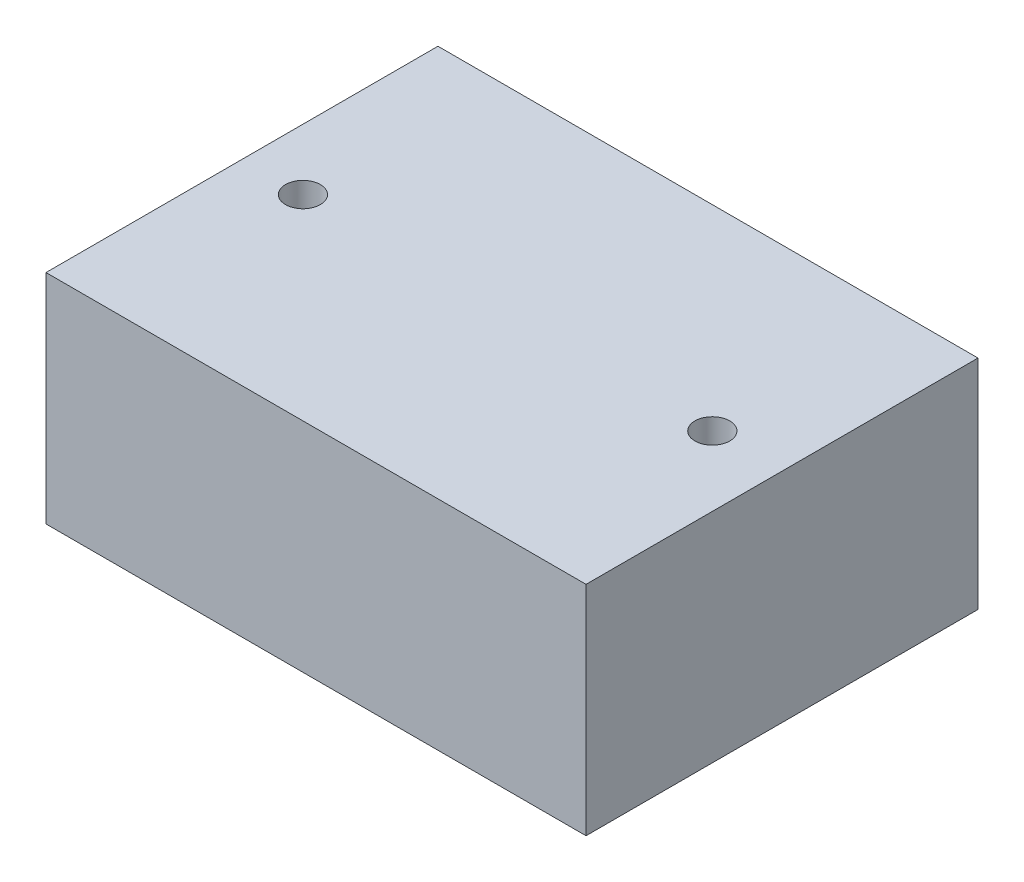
ISO-10303-21;
HEADER;
FILE_DESCRIPTION(('STEP AP214'),'2;1');
FILE_NAME('part.step','',(''),(''),'','','');
FILE_SCHEMA(('AUTOMOTIVE_DESIGN { 1 0 10303 214 1 1 1 1 }'));
ENDSEC;
DATA;
#1=APPLICATION_CONTEXT('core data for automotive mechanical design processes');
#2=APPLICATION_PROTOCOL_DEFINITION('international standard','automotive_design',2000,#1);
#3=PRODUCT_CONTEXT('',#1,'mechanical');
#4=PRODUCT('Part','Part','',(#3));
#5=PRODUCT_RELATED_PRODUCT_CATEGORY('part','',(#4));
#6=PRODUCT_DEFINITION_FORMATION('','',#4);
#7=PRODUCT_DEFINITION_CONTEXT('part definition',#1,'design');
#8=PRODUCT_DEFINITION('design','',#6,#7);
#9=PRODUCT_DEFINITION_SHAPE('','',#8);
#10=(LENGTH_UNIT() NAMED_UNIT(*) SI_UNIT(.MILLI.,.METRE.));
#11=(NAMED_UNIT(*) PLANE_ANGLE_UNIT() SI_UNIT($,.RADIAN.));
#12=(NAMED_UNIT(*) SI_UNIT($,.STERADIAN.) SOLID_ANGLE_UNIT());
#13=UNCERTAINTY_MEASURE_WITH_UNIT(LENGTH_MEASURE(1.E-05),#10,'distance_accuracy_value','');
#14=(GEOMETRIC_REPRESENTATION_CONTEXT(3) GLOBAL_UNCERTAINTY_ASSIGNED_CONTEXT((#13)) GLOBAL_UNIT_ASSIGNED_CONTEXT((#10,
#11,#12)) REPRESENTATION_CONTEXT('',''));
#15=CARTESIAN_POINT('',(0.,0.,0.));
#16=DIRECTION('',(0.,0.,1.));
#17=DIRECTION('',(1.,0.,0.));
#18=AXIS2_PLACEMENT_3D('',#15,#16,#17);
#19=CARTESIAN_POINT('',(-419.1,551.8,1054.8));
#20=DIRECTION('',(0.,1.,0.));
#21=DIRECTION('',(0.,0.,1.));
#22=AXIS2_PLACEMENT_3D('',#19,#20,#21);
#23=PLANE('',#22);
#24=CARTESIAN_POINT('',(-425.,551.8,1002.5));
#25=DIRECTION('',(0.,-1.,0.));
#26=DIRECTION('',(1.,0.,0.));
#27=AXIS2_PLACEMENT_3D('',#24,#25,#26);
#28=CIRCLE('',#27,2.0000000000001);
#29=CARTESIAN_POINT('',(-423.,551.8,1002.5));
#30=VERTEX_POINT('',#29);
#31=EDGE_CURVE('E11',#30,#30,#28,.T.);
#32=ORIENTED_EDGE('',*,*,#31,.T.);
#33=EDGE_LOOP('',(#32));
#34=FACE_BOUND('',#33,.T.);
#35=CARTESIAN_POINT('',(-378.,551.8,1002.5));
#36=DIRECTION('',(0.,-1.,0.));
#37=DIRECTION('',(1.,0.,0.));
#38=AXIS2_PLACEMENT_3D('',#35,#36,#37);
#39=CIRCLE('',#38,2.00000000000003);
#40=CARTESIAN_POINT('',(-376.,551.8,1002.5));
#41=VERTEX_POINT('',#40);
#42=EDGE_CURVE('E27',#41,#41,#39,.T.);
#43=ORIENTED_EDGE('',*,*,#42,.T.);
#44=EDGE_LOOP('',(#43));
#45=FACE_BOUND('',#44,.T.);
#46=DIRECTION('',(1.,0.,0.));
#47=VECTOR('',#46,1.);
#48=CARTESIAN_POINT('',(-432.,551.8,1025.));
#49=LINE('',#48,#47);
#50=CARTESIAN_POINT('',(-432.,551.8,1025.));
#51=VERTEX_POINT('',#50);
#52=CARTESIAN_POINT('',(-370.,551.8,1025.));
#53=VERTEX_POINT('',#52);
#54=EDGE_CURVE('E81',#51,#53,#49,.T.);
#55=ORIENTED_EDGE('',*,*,#54,.T.);
#56=DIRECTION('',(0.,0.,-1.));
#57=VECTOR('',#56,1.);
#58=CARTESIAN_POINT('',(-370.,551.8,1025.));
#59=LINE('',#58,#57);
#60=CARTESIAN_POINT('',(-370.,551.8,980.));
#61=VERTEX_POINT('',#60);
#62=EDGE_CURVE('E36',#53,#61,#59,.T.);
#63=ORIENTED_EDGE('',*,*,#62,.T.);
#64=DIRECTION('',(-1.,0.,0.));
#65=VECTOR('',#64,1.);
#66=CARTESIAN_POINT('',(-370.,551.8,980.));
#67=LINE('',#66,#65);
#68=CARTESIAN_POINT('',(-432.,551.8,980.));
#69=VERTEX_POINT('',#68);
#70=EDGE_CURVE('E68',#61,#69,#67,.T.);
#71=ORIENTED_EDGE('',*,*,#70,.T.);
#72=DIRECTION('',(0.,0.,1.));
#73=VECTOR('',#72,1.);
#74=CARTESIAN_POINT('',(-432.,551.8,980.));
#75=LINE('',#74,#73);
#76=EDGE_CURVE('E73',#69,#51,#75,.T.);
#77=ORIENTED_EDGE('',*,*,#76,.T.);
#78=EDGE_LOOP('',(#55,#63,#71,#77));
#79=FACE_BOUND('',#78,.T.);
#80=ADVANCED_FACE('F17',(#34,#45,#79),#23,.T.);
#81=CARTESIAN_POINT('',(-419.1,526.8,1054.8));
#82=DIRECTION('',(0.,-1.,0.));
#83=DIRECTION('',(0.,0.,-1.));
#84=AXIS2_PLACEMENT_3D('',#81,#82,#83);
#85=PLANE('',#84);
#86=CARTESIAN_POINT('',(-425.,526.8,1002.5));
#87=DIRECTION('',(0.,1.,0.));
#88=DIRECTION('',(1.,0.,0.));
#89=AXIS2_PLACEMENT_3D('',#86,#87,#88);
#90=CIRCLE('',#89,2.0000000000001);
#91=CARTESIAN_POINT('',(-423.,526.8,1002.5));
#92=VERTEX_POINT('',#91);
#93=EDGE_CURVE('E78',#92,#92,#90,.T.);
#94=ORIENTED_EDGE('',*,*,#93,.T.);
#95=EDGE_LOOP('',(#94));
#96=FACE_BOUND('',#95,.T.);
#97=CARTESIAN_POINT('',(-378.,526.8,1002.5));
#98=DIRECTION('',(0.,1.,0.));
#99=DIRECTION('',(1.,0.,0.));
#100=AXIS2_PLACEMENT_3D('',#97,#98,#99);
#101=CIRCLE('',#100,2.00000000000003);
#102=CARTESIAN_POINT('',(-376.,526.8,1002.5));
#103=VERTEX_POINT('',#102);
#104=EDGE_CURVE('E127',#103,#103,#101,.T.);
#105=ORIENTED_EDGE('',*,*,#104,.T.);
#106=EDGE_LOOP('',(#105));
#107=FACE_BOUND('',#106,.T.);
#108=DIRECTION('',(-1.,0.,0.));
#109=VECTOR('',#108,1.);
#110=CARTESIAN_POINT('',(-432.,526.8,1025.));
#111=LINE('',#110,#109);
#112=CARTESIAN_POINT('',(-370.,526.8,1025.));
#113=VERTEX_POINT('',#112);
#114=CARTESIAN_POINT('',(-432.,526.8,1025.));
#115=VERTEX_POINT('',#114);
#116=EDGE_CURVE('E129',#113,#115,#111,.T.);
#117=ORIENTED_EDGE('',*,*,#116,.T.);
#118=DIRECTION('',(0.,0.,-1.));
#119=VECTOR('',#118,1.);
#120=CARTESIAN_POINT('',(-432.,526.8,980.));
#121=LINE('',#120,#119);
#122=CARTESIAN_POINT('',(-432.,526.8,980.));
#123=VERTEX_POINT('',#122);
#124=EDGE_CURVE('E52',#115,#123,#121,.T.);
#125=ORIENTED_EDGE('',*,*,#124,.T.);
#126=DIRECTION('',(1.,0.,0.));
#127=VECTOR('',#126,1.);
#128=CARTESIAN_POINT('',(-370.,526.8,980.));
#129=LINE('',#128,#127);
#130=CARTESIAN_POINT('',(-370.,526.8,980.));
#131=VERTEX_POINT('',#130);
#132=EDGE_CURVE('E70',#123,#131,#129,.T.);
#133=ORIENTED_EDGE('',*,*,#132,.T.);
#134=DIRECTION('',(0.,0.,1.));
#135=VECTOR('',#134,1.);
#136=CARTESIAN_POINT('',(-370.,526.8,1025.));
#137=LINE('',#136,#135);
#138=EDGE_CURVE('E89',#131,#113,#137,.T.);
#139=ORIENTED_EDGE('',*,*,#138,.T.);
#140=EDGE_LOOP('',(#117,#125,#133,#139));
#141=FACE_BOUND('',#140,.T.);
#142=ADVANCED_FACE('F107',(#96,#107,#141),#85,.T.);
#143=CARTESIAN_POINT('',(-370.,551.8,1025.));
#144=DIRECTION('',(0.,0.,1.));
#145=DIRECTION('',(1.,0.,0.));
#146=AXIS2_PLACEMENT_3D('',#143,#144,#145);
#147=PLANE('',#146);
#148=ORIENTED_EDGE('',*,*,#54,.F.);
#149=DIRECTION('',(0.,-1.,0.));
#150=VECTOR('',#149,1.);
#151=CARTESIAN_POINT('',(-432.,551.8,1025.));
#152=LINE('',#151,#150);
#153=EDGE_CURVE('E71',#51,#115,#152,.T.);
#154=ORIENTED_EDGE('',*,*,#153,.T.);
#155=ORIENTED_EDGE('',*,*,#116,.F.);
#156=DIRECTION('',(0.,-1.,0.));
#157=VECTOR('',#156,1.);
#158=CARTESIAN_POINT('',(-370.,551.8,1025.));
#159=LINE('',#158,#157);
#160=EDGE_CURVE('E91',#53,#113,#159,.T.);
#161=ORIENTED_EDGE('',*,*,#160,.F.);
#162=EDGE_LOOP('',(#148,#154,#155,#161));
#163=FACE_BOUND('',#162,.T.);
#164=ADVANCED_FACE('F104',(#163),#147,.T.);
#165=CARTESIAN_POINT('',(-432.,551.8,1025.));
#166=DIRECTION('',(-1.,0.,0.));
#167=DIRECTION('',(0.,0.,1.));
#168=AXIS2_PLACEMENT_3D('',#165,#166,#167);
#169=PLANE('',#168);
#170=ORIENTED_EDGE('',*,*,#76,.F.);
#171=DIRECTION('',(0.,-1.,0.));
#172=VECTOR('',#171,1.);
#173=CARTESIAN_POINT('',(-432.,551.8,980.));
#174=LINE('',#173,#172);
#175=EDGE_CURVE('E57',#69,#123,#174,.T.);
#176=ORIENTED_EDGE('',*,*,#175,.T.);
#177=ORIENTED_EDGE('',*,*,#124,.F.);
#178=ORIENTED_EDGE('',*,*,#153,.F.);
#179=EDGE_LOOP('',(#170,#176,#177,#178));
#180=FACE_BOUND('',#179,.T.);
#181=ADVANCED_FACE('F74',(#180),#169,.T.);
#182=CARTESIAN_POINT('',(-432.,551.8,980.));
#183=DIRECTION('',(0.,0.,-1.));
#184=DIRECTION('',(-1.,0.,0.));
#185=AXIS2_PLACEMENT_3D('',#182,#183,#184);
#186=PLANE('',#185);
#187=ORIENTED_EDGE('',*,*,#70,.F.);
#188=DIRECTION('',(0.,-1.,0.));
#189=VECTOR('',#188,1.);
#190=CARTESIAN_POINT('',(-370.,551.8,980.));
#191=LINE('',#190,#189);
#192=EDGE_CURVE('E63',#61,#131,#191,.T.);
#193=ORIENTED_EDGE('',*,*,#192,.T.);
#194=ORIENTED_EDGE('',*,*,#132,.F.);
#195=ORIENTED_EDGE('',*,*,#175,.F.);
#196=EDGE_LOOP('',(#187,#193,#194,#195));
#197=FACE_BOUND('',#196,.T.);
#198=ADVANCED_FACE('F66',(#197),#186,.T.);
#199=CARTESIAN_POINT('',(-370.,551.8,980.));
#200=DIRECTION('',(1.,0.,0.));
#201=DIRECTION('',(0.,0.,-1.));
#202=AXIS2_PLACEMENT_3D('',#199,#200,#201);
#203=PLANE('',#202);
#204=ORIENTED_EDGE('',*,*,#62,.F.);
#205=ORIENTED_EDGE('',*,*,#160,.T.);
#206=ORIENTED_EDGE('',*,*,#138,.F.);
#207=ORIENTED_EDGE('',*,*,#192,.F.);
#208=EDGE_LOOP('',(#204,#205,#206,#207));
#209=FACE_BOUND('',#208,.T.);
#210=ADVANCED_FACE('F96',(#209),#203,.T.);
#211=CARTESIAN_POINT('',(-425.,526.8,1002.5));
#212=DIRECTION('',(0.,-1.,0.));
#213=DIRECTION('',(1.,0.,0.));
#214=AXIS2_PLACEMENT_3D('',#211,#212,#213);
#215=CIRCLE('',#214,2.0000000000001);
#216=DIRECTION('',(0.,1.,0.));
#217=VECTOR('',#216,1.);
#218=SURFACE_OF_LINEAR_EXTRUSION('',#215,#217);
#219=ORIENTED_EDGE('',*,*,#93,.F.);
#220=EDGE_LOOP('',(#219));
#221=FACE_BOUND('',#220,.T.);
#222=ORIENTED_EDGE('',*,*,#31,.F.);
#223=EDGE_LOOP('',(#222));
#224=FACE_BOUND('',#223,.T.);
#225=ADVANCED_FACE('F93',(#221,#224),#218,.T.);
#226=CARTESIAN_POINT('',(-378.,526.8,1002.5));
#227=DIRECTION('',(0.,-1.,0.));
#228=DIRECTION('',(1.,0.,0.));
#229=AXIS2_PLACEMENT_3D('',#226,#227,#228);
#230=CIRCLE('',#229,2.00000000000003);
#231=DIRECTION('',(0.,1.,0.));
#232=VECTOR('',#231,1.);
#233=SURFACE_OF_LINEAR_EXTRUSION('',#230,#232);
#234=ORIENTED_EDGE('',*,*,#104,.F.);
#235=EDGE_LOOP('',(#234));
#236=FACE_BOUND('',#235,.T.);
#237=ORIENTED_EDGE('',*,*,#42,.F.);
#238=EDGE_LOOP('',(#237));
#239=FACE_BOUND('',#238,.T.);
#240=ADVANCED_FACE('F19',(#236,#239),#233,.T.);
#241=CLOSED_SHELL('',(#80,#142,#164,#181,#198,#210,#225,#240));
#242=MANIFOLD_SOLID_BREP('B1',#241);
#243=ADVANCED_BREP_SHAPE_REPRESENTATION('',(#18,#242),#14);
#244=SHAPE_DEFINITION_REPRESENTATION(#9,#243);
ENDSEC;
END-ISO-10303-21;
